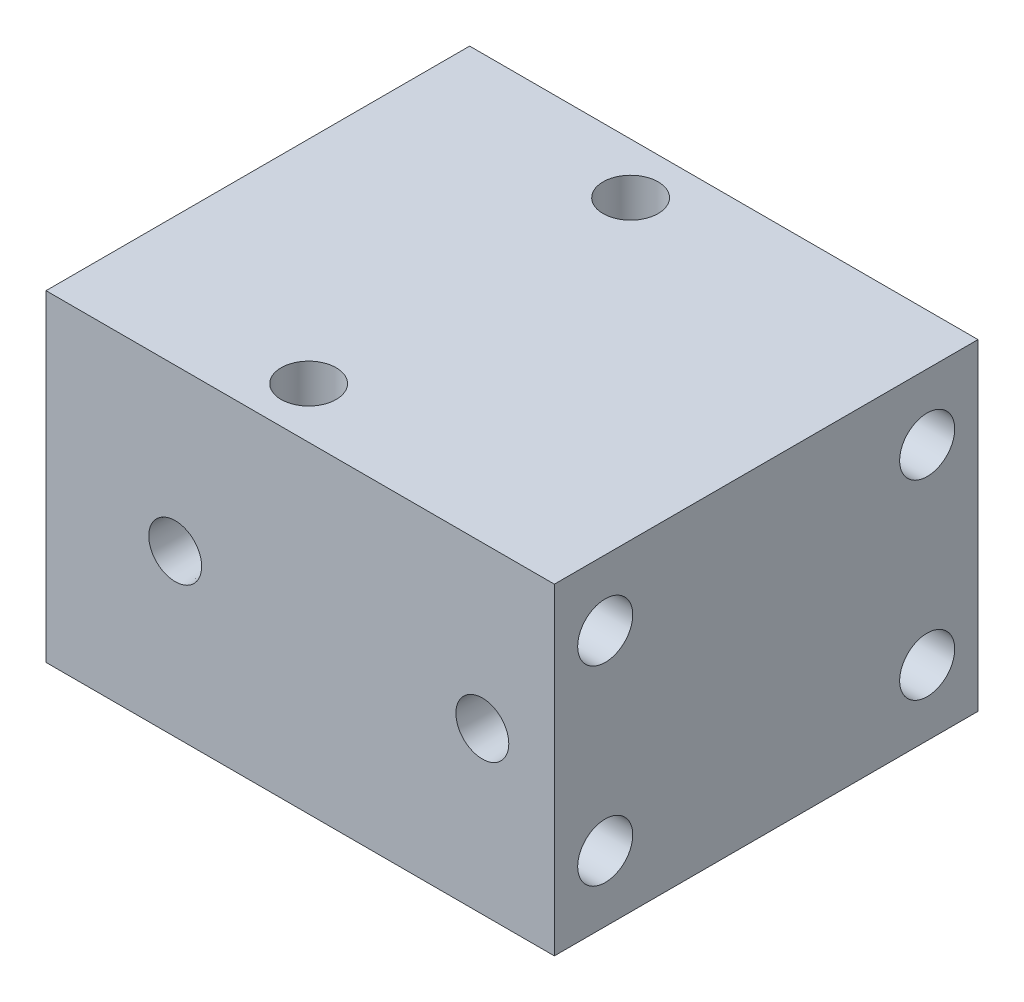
ISO-10303-21;
HEADER;
FILE_DESCRIPTION(('STEP AP214'),'2;1');
FILE_NAME('part.step','',(''),(''),'','','');
FILE_SCHEMA(('AUTOMOTIVE_DESIGN { 1 0 10303 214 1 1 1 1 }'));
ENDSEC;
DATA;
#1=APPLICATION_CONTEXT('core data for automotive mechanical design processes');
#2=APPLICATION_PROTOCOL_DEFINITION('international standard','automotive_design',2000,#1);
#3=PRODUCT_CONTEXT('',#1,'mechanical');
#4=PRODUCT('Part','Part','',(#3));
#5=PRODUCT_RELATED_PRODUCT_CATEGORY('part','',(#4));
#6=PRODUCT_DEFINITION_FORMATION('','',#4);
#7=PRODUCT_DEFINITION_CONTEXT('part definition',#1,'design');
#8=PRODUCT_DEFINITION('design','',#6,#7);
#9=PRODUCT_DEFINITION_SHAPE('','',#8);
#10=(LENGTH_UNIT() NAMED_UNIT(*) SI_UNIT(.MILLI.,.METRE.));
#11=(NAMED_UNIT(*) PLANE_ANGLE_UNIT() SI_UNIT($,.RADIAN.));
#12=(NAMED_UNIT(*) SI_UNIT($,.STERADIAN.) SOLID_ANGLE_UNIT());
#13=UNCERTAINTY_MEASURE_WITH_UNIT(LENGTH_MEASURE(1.E-05),#10,'distance_accuracy_value','');
#14=(GEOMETRIC_REPRESENTATION_CONTEXT(3) GLOBAL_UNCERTAINTY_ASSIGNED_CONTEXT((#13)) GLOBAL_UNIT_ASSIGNED_CONTEXT((#10,
#11,#12)) REPRESENTATION_CONTEXT('',''));
#15=CARTESIAN_POINT('',(0.,0.,0.));
#16=DIRECTION('',(0.,0.,1.));
#17=DIRECTION('',(1.,0.,0.));
#18=AXIS2_PLACEMENT_3D('',#15,#16,#17);
#19=CARTESIAN_POINT('',(-9.99999999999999,76.,38.));
#20=DIRECTION('',(0.,-1.,0.));
#21=DIRECTION('',(0.,0.,-1.));
#22=AXIS2_PLACEMENT_3D('',#19,#20,#21);
#23=CYLINDRICAL_SURFACE('',#22,6.5);
#24=CARTESIAN_POINT('',(-9.99999999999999,15.5,38.));
#25=DIRECTION('',(-0.707106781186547,-0.707106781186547,0.));
#26=DIRECTION('',(0.707106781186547,-0.707106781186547,0.));
#27=AXIS2_PLACEMENT_3D('',#24,#25,#26);
#28=ELLIPSE('',#27,9.19238815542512,6.5);
#29=CARTESIAN_POINT('',(-9.99999999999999,15.5,31.5));
#30=VERTEX_POINT('',#29);
#31=CARTESIAN_POINT('',(-9.99999999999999,15.5,44.5));
#32=VERTEX_POINT('',#31);
#33=EDGE_CURVE('E11',#30,#32,#28,.F.);
#34=ORIENTED_EDGE('',*,*,#33,.F.);
#35=CARTESIAN_POINT('',(-9.99999999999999,15.5,38.));
#36=DIRECTION('',(0.707106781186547,-0.707106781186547,0.));
#37=DIRECTION('',(-0.707106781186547,-0.707106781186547,0.));
#38=AXIS2_PLACEMENT_3D('',#35,#36,#37);
#39=ELLIPSE('',#38,9.19238815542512,6.5);
#40=EDGE_CURVE('E49',#32,#30,#39,.F.);
#41=ORIENTED_EDGE('',*,*,#40,.F.);
#42=EDGE_LOOP('',(#34,#41));
#43=FACE_BOUND('',#42,.T.);
#44=CARTESIAN_POINT('',(-9.99999999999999,60.5,38.));
#45=DIRECTION('',(-0.707106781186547,-0.707106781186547,0.));
#46=DIRECTION('',(0.707106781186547,-0.707106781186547,0.));
#47=AXIS2_PLACEMENT_3D('',#44,#45,#46);
#48=ELLIPSE('',#47,9.19238815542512,6.5);
#49=CARTESIAN_POINT('',(-9.99999999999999,60.5,31.5));
#50=VERTEX_POINT('',#49);
#51=CARTESIAN_POINT('',(-9.99999999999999,60.5,44.5));
#52=VERTEX_POINT('',#51);
#53=EDGE_CURVE('E263',#50,#52,#48,.T.);
#54=ORIENTED_EDGE('',*,*,#53,.F.);
#55=CARTESIAN_POINT('',(-9.99999999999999,60.5,38.));
#56=DIRECTION('',(0.707106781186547,-0.707106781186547,0.));
#57=DIRECTION('',(-0.707106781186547,-0.707106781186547,0.));
#58=AXIS2_PLACEMENT_3D('',#55,#56,#57);
#59=ELLIPSE('',#58,9.19238815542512,6.5);
#60=EDGE_CURVE('E261',#52,#50,#59,.T.);
#61=ORIENTED_EDGE('',*,*,#60,.F.);
#62=EDGE_LOOP('',(#54,#61));
#63=FACE_BOUND('',#62,.T.);
#64=ADVANCED_FACE('F33',(#43,#63),#23,.F.);
#65=CARTESIAN_POINT('',(-9.99999999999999,60.5,38.));
#66=DIRECTION('',(-0.707106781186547,-0.707106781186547,0.));
#67=DIRECTION('',(0.707106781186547,-0.707106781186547,0.));
#68=AXIS2_PLACEMENT_3D('',#65,#66,#67);
#69=ELLIPSE('',#68,9.19238815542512,6.5);
#70=EDGE_CURVE('E116',#50,#52,#69,.F.);
#71=ORIENTED_EDGE('',*,*,#70,.F.);
#72=CARTESIAN_POINT('',(-9.99999999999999,60.5,38.));
#73=DIRECTION('',(0.707106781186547,-0.707106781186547,0.));
#74=DIRECTION('',(-0.707106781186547,-0.707106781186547,0.));
#75=AXIS2_PLACEMENT_3D('',#72,#73,#74);
#76=ELLIPSE('',#75,9.19238815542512,6.5);
#77=EDGE_CURVE('E56',#52,#50,#76,.F.);
#78=ORIENTED_EDGE('',*,*,#77,.F.);
#79=EDGE_LOOP('',(#71,#78));
#80=FACE_BOUND('',#79,.T.);
#81=CARTESIAN_POINT('',(-9.99999999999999,76.,38.));
#82=DIRECTION('',(0.,1.,0.));
#83=DIRECTION('',(0.,0.,1.));
#84=AXIS2_PLACEMENT_3D('',#81,#82,#83);
#85=CIRCLE('',#84,6.5);
#86=CARTESIAN_POINT('',(-9.99999999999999,76.,44.5));
#87=VERTEX_POINT('',#86);
#88=EDGE_CURVE('E197',#87,#87,#85,.T.);
#89=ORIENTED_EDGE('',*,*,#88,.T.);
#90=EDGE_LOOP('',(#89));
#91=FACE_BOUND('',#90,.T.);
#92=ADVANCED_FACE('F318',(#80,#91),#23,.F.);
#93=CARTESIAN_POINT('',(-9.99999999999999,76.,-38.));
#94=DIRECTION('',(0.,-1.,0.));
#95=DIRECTION('',(0.,0.,-1.));
#96=AXIS2_PLACEMENT_3D('',#93,#94,#95);
#97=CYLINDRICAL_SURFACE('',#96,6.5);
#98=CARTESIAN_POINT('',(-9.99999999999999,15.5,-38.));
#99=DIRECTION('',(-0.707106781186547,-0.707106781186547,0.));
#100=DIRECTION('',(0.707106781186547,-0.707106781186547,0.));
#101=AXIS2_PLACEMENT_3D('',#98,#99,#100);
#102=ELLIPSE('',#101,9.19238815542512,6.5);
#103=CARTESIAN_POINT('',(-9.99999999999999,15.5,-44.5));
#104=VERTEX_POINT('',#103);
#105=CARTESIAN_POINT('',(-9.99999999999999,15.5,-31.5));
#106=VERTEX_POINT('',#105);
#107=EDGE_CURVE('E257',#104,#106,#102,.F.);
#108=ORIENTED_EDGE('',*,*,#107,.F.);
#109=CARTESIAN_POINT('',(-9.99999999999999,15.5,-38.));
#110=DIRECTION('',(0.707106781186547,-0.707106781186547,0.));
#111=DIRECTION('',(-0.707106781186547,-0.707106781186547,0.));
#112=AXIS2_PLACEMENT_3D('',#109,#110,#111);
#113=ELLIPSE('',#112,9.19238815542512,6.5);
#114=EDGE_CURVE('E249',#106,#104,#113,.F.);
#115=ORIENTED_EDGE('',*,*,#114,.F.);
#116=EDGE_LOOP('',(#108,#115));
#117=FACE_BOUND('',#116,.T.);
#118=CARTESIAN_POINT('',(-9.99999999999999,60.5,-38.));
#119=DIRECTION('',(-0.707106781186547,-0.707106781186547,0.));
#120=DIRECTION('',(0.707106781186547,-0.707106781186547,0.));
#121=AXIS2_PLACEMENT_3D('',#118,#119,#120);
#122=ELLIPSE('',#121,9.19238815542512,6.5);
#123=CARTESIAN_POINT('',(-9.99999999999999,60.5,-44.5));
#124=VERTEX_POINT('',#123);
#125=CARTESIAN_POINT('',(-9.99999999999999,60.5,-31.5));
#126=VERTEX_POINT('',#125);
#127=EDGE_CURVE('E243',#124,#126,#122,.T.);
#128=ORIENTED_EDGE('',*,*,#127,.F.);
#129=CARTESIAN_POINT('',(-9.99999999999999,60.5,-38.));
#130=DIRECTION('',(0.707106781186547,-0.707106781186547,0.));
#131=DIRECTION('',(-0.707106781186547,-0.707106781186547,0.));
#132=AXIS2_PLACEMENT_3D('',#129,#130,#131);
#133=ELLIPSE('',#132,9.19238815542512,6.5);
#134=EDGE_CURVE('E241',#126,#124,#133,.T.);
#135=ORIENTED_EDGE('',*,*,#134,.F.);
#136=EDGE_LOOP('',(#128,#135));
#137=FACE_BOUND('',#136,.T.);
#138=ADVANCED_FACE('F323',(#117,#137),#97,.F.);
#139=CARTESIAN_POINT('',(-9.99999999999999,60.5,-38.));
#140=DIRECTION('',(-0.707106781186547,-0.707106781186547,0.));
#141=DIRECTION('',(0.707106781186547,-0.707106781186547,0.));
#142=AXIS2_PLACEMENT_3D('',#139,#140,#141);
#143=ELLIPSE('',#142,9.19238815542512,6.5);
#144=EDGE_CURVE('E246',#124,#126,#143,.F.);
#145=ORIENTED_EDGE('',*,*,#144,.F.);
#146=CARTESIAN_POINT('',(-9.99999999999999,60.5,-38.));
#147=DIRECTION('',(0.707106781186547,-0.707106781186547,0.));
#148=DIRECTION('',(-0.707106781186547,-0.707106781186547,0.));
#149=AXIS2_PLACEMENT_3D('',#146,#147,#148);
#150=ELLIPSE('',#149,9.19238815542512,6.5);
#151=EDGE_CURVE('E238',#126,#124,#150,.F.);
#152=ORIENTED_EDGE('',*,*,#151,.F.);
#153=EDGE_LOOP('',(#145,#152));
#154=FACE_BOUND('',#153,.T.);
#155=CARTESIAN_POINT('',(-9.99999999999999,76.,-38.));
#156=DIRECTION('',(0.,1.,0.));
#157=DIRECTION('',(0.,0.,1.));
#158=AXIS2_PLACEMENT_3D('',#155,#156,#157);
#159=CIRCLE('',#158,6.5);
#160=CARTESIAN_POINT('',(-9.99999999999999,76.,-31.5));
#161=VERTEX_POINT('',#160);
#162=EDGE_CURVE('E203',#161,#161,#159,.T.);
#163=ORIENTED_EDGE('',*,*,#162,.T.);
#164=EDGE_LOOP('',(#163));
#165=FACE_BOUND('',#164,.T.);
#166=ADVANCED_FACE('F336',(#154,#165),#97,.F.);
#167=CARTESIAN_POINT('',(-60.,76.,50.));
#168=DIRECTION('',(0.,1.,0.));
#169=DIRECTION('',(0.,0.,1.));
#170=AXIS2_PLACEMENT_3D('',#167,#168,#169);
#171=PLANE('',#170);
#172=ORIENTED_EDGE('',*,*,#162,.F.);
#173=EDGE_LOOP('',(#172));
#174=FACE_BOUND('',#173,.T.);
#175=DIRECTION('',(0.,0.,1.));
#176=VECTOR('',#175,1.);
#177=CARTESIAN_POINT('',(-60.,76.,-50.));
#178=LINE('',#177,#176);
#179=CARTESIAN_POINT('',(-60.,76.,-50.));
#180=VERTEX_POINT('',#179);
#181=CARTESIAN_POINT('',(-60.,76.,50.));
#182=VERTEX_POINT('',#181);
#183=EDGE_CURVE('E209',#180,#182,#178,.T.);
#184=ORIENTED_EDGE('',*,*,#183,.T.);
#185=DIRECTION('',(1.,0.,0.));
#186=VECTOR('',#185,1.);
#187=CARTESIAN_POINT('',(-60.,76.,50.));
#188=LINE('',#187,#186);
#189=CARTESIAN_POINT('',(60.,76.,50.));
#190=VERTEX_POINT('',#189);
#191=EDGE_CURVE('E212',#182,#190,#188,.T.);
#192=ORIENTED_EDGE('',*,*,#191,.T.);
#193=DIRECTION('',(0.,0.,-1.));
#194=VECTOR('',#193,1.);
#195=CARTESIAN_POINT('',(60.,76.,-50.));
#196=LINE('',#195,#194);
#197=CARTESIAN_POINT('',(60.,76.,-50.));
#198=VERTEX_POINT('',#197);
#199=EDGE_CURVE('E215',#190,#198,#196,.T.);
#200=ORIENTED_EDGE('',*,*,#199,.T.);
#201=DIRECTION('',(-1.,0.,0.));
#202=VECTOR('',#201,1.);
#203=CARTESIAN_POINT('',(-60.,76.,-50.));
#204=LINE('',#203,#202);
#205=EDGE_CURVE('E217',#198,#180,#204,.T.);
#206=ORIENTED_EDGE('',*,*,#205,.T.);
#207=EDGE_LOOP('',(#184,#192,#200,#206));
#208=FACE_BOUND('',#207,.T.);
#209=ORIENTED_EDGE('',*,*,#88,.F.);
#210=EDGE_LOOP('',(#209));
#211=FACE_BOUND('',#210,.T.);
#212=ADVANCED_FACE('F306',(#174,#208,#211),#171,.T.);
#213=CARTESIAN_POINT('',(-60.,0.,50.));
#214=DIRECTION('',(0.,1.,0.));
#215=DIRECTION('',(0.,0.,1.));
#216=AXIS2_PLACEMENT_3D('',#213,#214,#215);
#217=PLANE('',#216);
#218=CARTESIAN_POINT('',(-9.99999999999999,0.,-38.));
#219=DIRECTION('',(0.,1.,0.));
#220=DIRECTION('',(0.,0.,1.));
#221=AXIS2_PLACEMENT_3D('',#218,#219,#220);
#222=CIRCLE('',#221,6.5);
#223=CARTESIAN_POINT('',(-9.99999999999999,0.,-31.5));
#224=VERTEX_POINT('',#223);
#225=EDGE_CURVE('E200',#224,#224,#222,.T.);
#226=ORIENTED_EDGE('',*,*,#225,.T.);
#227=EDGE_LOOP('',(#226));
#228=FACE_BOUND('',#227,.T.);
#229=DIRECTION('',(0.,0.,1.));
#230=VECTOR('',#229,1.);
#231=CARTESIAN_POINT('',(-60.,0.,-50.));
#232=LINE('',#231,#230);
#233=CARTESIAN_POINT('',(-60.,0.,-50.));
#234=VERTEX_POINT('',#233);
#235=CARTESIAN_POINT('',(-60.,0.,50.));
#236=VERTEX_POINT('',#235);
#237=EDGE_CURVE('E206',#234,#236,#232,.T.);
#238=ORIENTED_EDGE('',*,*,#237,.F.);
#239=DIRECTION('',(-1.,0.,0.));
#240=VECTOR('',#239,1.);
#241=CARTESIAN_POINT('',(-60.,0.,-50.));
#242=LINE('',#241,#240);
#243=CARTESIAN_POINT('',(60.,0.,-50.));
#244=VERTEX_POINT('',#243);
#245=EDGE_CURVE('E213',#244,#234,#242,.T.);
#246=ORIENTED_EDGE('',*,*,#245,.F.);
#247=DIRECTION('',(0.,0.,-1.));
#248=VECTOR('',#247,1.);
#249=CARTESIAN_POINT('',(60.,0.,-50.));
#250=LINE('',#249,#248);
#251=CARTESIAN_POINT('',(60.,0.,50.));
#252=VERTEX_POINT('',#251);
#253=EDGE_CURVE('E224',#252,#244,#250,.T.);
#254=ORIENTED_EDGE('',*,*,#253,.F.);
#255=DIRECTION('',(1.,0.,0.));
#256=VECTOR('',#255,1.);
#257=CARTESIAN_POINT('',(-60.,0.,50.));
#258=LINE('',#257,#256);
#259=EDGE_CURVE('E222',#236,#252,#258,.T.);
#260=ORIENTED_EDGE('',*,*,#259,.F.);
#261=EDGE_LOOP('',(#238,#246,#254,#260));
#262=FACE_BOUND('',#261,.T.);
#263=CARTESIAN_POINT('',(-9.99999999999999,0.,38.));
#264=DIRECTION('',(0.,1.,0.));
#265=DIRECTION('',(0.,0.,1.));
#266=AXIS2_PLACEMENT_3D('',#263,#264,#265);
#267=CIRCLE('',#266,6.5);
#268=CARTESIAN_POINT('',(-9.99999999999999,0.,44.5));
#269=VERTEX_POINT('',#268);
#270=EDGE_CURVE('E194',#269,#269,#267,.T.);
#271=ORIENTED_EDGE('',*,*,#270,.T.);
#272=EDGE_LOOP('',(#271));
#273=FACE_BOUND('',#272,.T.);
#274=ADVANCED_FACE('F300',(#228,#262,#273),#217,.F.);
#275=CARTESIAN_POINT('',(-60.,76.,-50.));
#276=DIRECTION('',(1.,0.,0.));
#277=DIRECTION('',(0.,0.,-1.));
#278=AXIS2_PLACEMENT_3D('',#275,#276,#277);
#279=PLANE('',#278);
#280=CARTESIAN_POINT('',(-60.,15.5,38.));
#281=DIRECTION('',(-1.,0.,0.));
#282=DIRECTION('',(0.,0.,1.));
#283=AXIS2_PLACEMENT_3D('',#280,#281,#282);
#284=CIRCLE('',#283,6.5);
#285=CARTESIAN_POINT('',(-60.,15.5,44.5));
#286=VERTEX_POINT('',#285);
#287=EDGE_CURVE('E129',#286,#286,#284,.T.);
#288=ORIENTED_EDGE('',*,*,#287,.F.);
#289=EDGE_LOOP('',(#288));
#290=FACE_BOUND('',#289,.T.);
#291=CARTESIAN_POINT('',(-60.,60.5,38.));
#292=DIRECTION('',(-1.,0.,0.));
#293=DIRECTION('',(0.,0.,1.));
#294=AXIS2_PLACEMENT_3D('',#291,#292,#293);
#295=CIRCLE('',#294,6.5);
#296=CARTESIAN_POINT('',(-60.,60.5,44.5));
#297=VERTEX_POINT('',#296);
#298=EDGE_CURVE('E148',#297,#297,#295,.T.);
#299=ORIENTED_EDGE('',*,*,#298,.F.);
#300=EDGE_LOOP('',(#299));
#301=FACE_BOUND('',#300,.T.);
#302=CARTESIAN_POINT('',(-60.,15.5,-38.));
#303=DIRECTION('',(-1.,0.,0.));
#304=DIRECTION('',(0.,0.,1.));
#305=AXIS2_PLACEMENT_3D('',#302,#303,#304);
#306=CIRCLE('',#305,6.5);
#307=CARTESIAN_POINT('',(-60.,15.5,-31.5));
#308=VERTEX_POINT('',#307);
#309=EDGE_CURVE('E154',#308,#308,#306,.T.);
#310=ORIENTED_EDGE('',*,*,#309,.F.);
#311=EDGE_LOOP('',(#310));
#312=FACE_BOUND('',#311,.T.);
#313=CARTESIAN_POINT('',(-60.,60.5,-38.));
#314=DIRECTION('',(-1.,0.,0.));
#315=DIRECTION('',(0.,0.,1.));
#316=AXIS2_PLACEMENT_3D('',#313,#314,#315);
#317=CIRCLE('',#316,6.5);
#318=CARTESIAN_POINT('',(-60.,60.5,-31.5));
#319=VERTEX_POINT('',#318);
#320=EDGE_CURVE('E160',#319,#319,#317,.T.);
#321=ORIENTED_EDGE('',*,*,#320,.F.);
#322=EDGE_LOOP('',(#321));
#323=FACE_BOUND('',#322,.T.);
#324=CARTESIAN_POINT('',(-60.,38.,0.));
#325=DIRECTION('',(-1.,0.,0.));
#326=DIRECTION('',(0.,0.,1.));
#327=AXIS2_PLACEMENT_3D('',#324,#325,#326);
#328=CIRCLE('',#327,0.500000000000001);
#329=CARTESIAN_POINT('',(-60.,38.,0.500000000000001));
#330=VERTEX_POINT('',#329);
#331=EDGE_CURVE('E190',#330,#330,#328,.T.);
#332=ORIENTED_EDGE('',*,*,#331,.F.);
#333=EDGE_LOOP('',(#332));
#334=FACE_BOUND('',#333,.T.);
#335=ORIENTED_EDGE('',*,*,#237,.T.);
#336=DIRECTION('',(0.,-1.,0.));
#337=VECTOR('',#336,1.);
#338=CARTESIAN_POINT('',(-60.,76.,50.));
#339=LINE('',#338,#337);
#340=EDGE_CURVE('E235',#182,#236,#339,.T.);
#341=ORIENTED_EDGE('',*,*,#340,.F.);
#342=ORIENTED_EDGE('',*,*,#183,.F.);
#343=DIRECTION('',(0.,-1.,0.));
#344=VECTOR('',#343,1.);
#345=CARTESIAN_POINT('',(-60.,76.,-50.));
#346=LINE('',#345,#344);
#347=EDGE_CURVE('E219',#180,#234,#346,.T.);
#348=ORIENTED_EDGE('',*,*,#347,.T.);
#349=EDGE_LOOP('',(#335,#341,#342,#348));
#350=FACE_BOUND('',#349,.T.);
#351=ADVANCED_FACE('F35',(#290,#301,#312,#323,#334,#350),#279,.F.);
#352=CARTESIAN_POINT('',(-60.,76.,50.));
#353=DIRECTION('',(0.,0.,-1.));
#354=DIRECTION('',(-1.,0.,0.));
#355=AXIS2_PLACEMENT_3D('',#352,#353,#354);
#356=PLANE('',#355);
#357=CARTESIAN_POINT('',(43.,38.,50.));
#358=DIRECTION('',(0.,0.,1.));
#359=DIRECTION('',(1.,0.,0.));
#360=AXIS2_PLACEMENT_3D('',#357,#358,#359);
#361=CIRCLE('',#360,6.2436883);
#362=CARTESIAN_POINT('',(49.2436883,38.,50.));
#363=VERTEX_POINT('',#362);
#364=EDGE_CURVE('E166',#363,#363,#361,.T.);
#365=ORIENTED_EDGE('',*,*,#364,.F.);
#366=EDGE_LOOP('',(#365));
#367=FACE_BOUND('',#366,.T.);
#368=CARTESIAN_POINT('',(-29.5,38.,50.));
#369=DIRECTION('',(0.,0.,1.));
#370=DIRECTION('',(1.,0.,0.));
#371=AXIS2_PLACEMENT_3D('',#368,#369,#370);
#372=CIRCLE('',#371,6.2436883);
#373=CARTESIAN_POINT('',(-23.2563117,38.,50.));
#374=VERTEX_POINT('',#373);
#375=EDGE_CURVE('E178',#374,#374,#372,.T.);
#376=ORIENTED_EDGE('',*,*,#375,.F.);
#377=EDGE_LOOP('',(#376));
#378=FACE_BOUND('',#377,.T.);
#379=ORIENTED_EDGE('',*,*,#259,.T.);
#380=DIRECTION('',(0.,-1.,0.));
#381=VECTOR('',#380,1.);
#382=CARTESIAN_POINT('',(60.,76.,50.));
#383=LINE('',#382,#381);
#384=EDGE_CURVE('E232',#190,#252,#383,.T.);
#385=ORIENTED_EDGE('',*,*,#384,.F.);
#386=ORIENTED_EDGE('',*,*,#191,.F.);
#387=ORIENTED_EDGE('',*,*,#340,.T.);
#388=EDGE_LOOP('',(#379,#385,#386,#387));
#389=FACE_BOUND('',#388,.T.);
#390=ADVANCED_FACE('F283',(#367,#378,#389),#356,.F.);
#391=CARTESIAN_POINT('',(60.,76.,-50.));
#392=DIRECTION('',(-1.,0.,0.));
#393=DIRECTION('',(0.,0.,1.));
#394=AXIS2_PLACEMENT_3D('',#391,#392,#393);
#395=PLANE('',#394);
#396=CARTESIAN_POINT('',(60.,15.5,38.));
#397=DIRECTION('',(-1.,0.,0.));
#398=DIRECTION('',(0.,0.,1.));
#399=AXIS2_PLACEMENT_3D('',#396,#397,#398);
#400=CIRCLE('',#399,6.5);
#401=CARTESIAN_POINT('',(60.,15.5,44.5));
#402=VERTEX_POINT('',#401);
#403=EDGE_CURVE('E145',#402,#402,#400,.F.);
#404=ORIENTED_EDGE('',*,*,#403,.F.);
#405=EDGE_LOOP('',(#404));
#406=FACE_BOUND('',#405,.T.);
#407=CARTESIAN_POINT('',(60.,60.5,38.));
#408=DIRECTION('',(-1.,0.,0.));
#409=DIRECTION('',(0.,0.,1.));
#410=AXIS2_PLACEMENT_3D('',#407,#408,#409);
#411=CIRCLE('',#410,6.5);
#412=CARTESIAN_POINT('',(60.,60.5,44.5));
#413=VERTEX_POINT('',#412);
#414=EDGE_CURVE('E151',#413,#413,#411,.F.);
#415=ORIENTED_EDGE('',*,*,#414,.F.);
#416=EDGE_LOOP('',(#415));
#417=FACE_BOUND('',#416,.T.);
#418=CARTESIAN_POINT('',(60.,15.5,-38.));
#419=DIRECTION('',(-1.,0.,0.));
#420=DIRECTION('',(0.,0.,1.));
#421=AXIS2_PLACEMENT_3D('',#418,#419,#420);
#422=CIRCLE('',#421,6.5);
#423=CARTESIAN_POINT('',(60.,15.5,-31.5));
#424=VERTEX_POINT('',#423);
#425=EDGE_CURVE('E157',#424,#424,#422,.F.);
#426=ORIENTED_EDGE('',*,*,#425,.F.);
#427=EDGE_LOOP('',(#426));
#428=FACE_BOUND('',#427,.T.);
#429=CARTESIAN_POINT('',(60.,60.5,-38.));
#430=DIRECTION('',(-1.,0.,0.));
#431=DIRECTION('',(0.,0.,1.));
#432=AXIS2_PLACEMENT_3D('',#429,#430,#431);
#433=CIRCLE('',#432,6.5);
#434=CARTESIAN_POINT('',(60.,60.5,-31.5));
#435=VERTEX_POINT('',#434);
#436=EDGE_CURVE('E163',#435,#435,#433,.F.);
#437=ORIENTED_EDGE('',*,*,#436,.F.);
#438=EDGE_LOOP('',(#437));
#439=FACE_BOUND('',#438,.T.);
#440=ORIENTED_EDGE('',*,*,#253,.T.);
#441=DIRECTION('',(0.,-1.,0.));
#442=VECTOR('',#441,1.);
#443=CARTESIAN_POINT('',(60.,76.,-50.));
#444=LINE('',#443,#442);
#445=EDGE_CURVE('E229',#198,#244,#444,.T.);
#446=ORIENTED_EDGE('',*,*,#445,.F.);
#447=ORIENTED_EDGE('',*,*,#199,.F.);
#448=ORIENTED_EDGE('',*,*,#384,.T.);
#449=EDGE_LOOP('',(#440,#446,#447,#448));
#450=FACE_BOUND('',#449,.T.);
#451=ADVANCED_FACE('F279',(#406,#417,#428,#439,#450),#395,.F.);
#452=CARTESIAN_POINT('',(-60.,76.,-50.));
#453=DIRECTION('',(0.,0.,1.));
#454=DIRECTION('',(1.,0.,0.));
#455=AXIS2_PLACEMENT_3D('',#452,#453,#454);
#456=PLANE('',#455);
#457=ORIENTED_EDGE('',*,*,#245,.T.);
#458=ORIENTED_EDGE('',*,*,#347,.F.);
#459=ORIENTED_EDGE('',*,*,#205,.F.);
#460=ORIENTED_EDGE('',*,*,#445,.T.);
#461=EDGE_LOOP('',(#457,#458,#459,#460));
#462=FACE_BOUND('',#461,.T.);
#463=ADVANCED_FACE('F282',(#462),#456,.F.);
#464=CARTESIAN_POINT('',(-9.99999999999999,15.5,-38.));
#465=DIRECTION('',(-0.707106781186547,-0.707106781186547,0.));
#466=DIRECTION('',(0.707106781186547,-0.707106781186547,0.));
#467=AXIS2_PLACEMENT_3D('',#464,#465,#466);
#468=ELLIPSE('',#467,9.19238815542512,6.5);
#469=EDGE_CURVE('E254',#104,#106,#468,.T.);
#470=ORIENTED_EDGE('',*,*,#469,.F.);
#471=CARTESIAN_POINT('',(-9.99999999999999,15.5,-38.));
#472=DIRECTION('',(0.707106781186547,-0.707106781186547,0.));
#473=DIRECTION('',(-0.707106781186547,-0.707106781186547,0.));
#474=AXIS2_PLACEMENT_3D('',#471,#472,#473);
#475=ELLIPSE('',#474,9.19238815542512,6.5);
#476=EDGE_CURVE('E252',#106,#104,#475,.T.);
#477=ORIENTED_EDGE('',*,*,#476,.F.);
#478=EDGE_LOOP('',(#470,#477));
#479=FACE_BOUND('',#478,.T.);
#480=ORIENTED_EDGE('',*,*,#225,.F.);
#481=EDGE_LOOP('',(#480));
#482=FACE_BOUND('',#481,.T.);
#483=ADVANCED_FACE('F328',(#479,#482),#97,.F.);
#484=CARTESIAN_POINT('',(-9.99999999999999,15.5,38.));
#485=DIRECTION('',(-0.707106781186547,-0.707106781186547,0.));
#486=DIRECTION('',(0.707106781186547,-0.707106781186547,0.));
#487=AXIS2_PLACEMENT_3D('',#484,#485,#486);
#488=ELLIPSE('',#487,9.19238815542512,6.5);
#489=EDGE_CURVE('E42',#30,#32,#488,.T.);
#490=ORIENTED_EDGE('',*,*,#489,.F.);
#491=CARTESIAN_POINT('',(-9.99999999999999,15.5,38.));
#492=DIRECTION('',(0.707106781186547,-0.707106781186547,0.));
#493=DIRECTION('',(-0.707106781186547,-0.707106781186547,0.));
#494=AXIS2_PLACEMENT_3D('',#491,#492,#493);
#495=ELLIPSE('',#494,9.19238815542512,6.5);
#496=EDGE_CURVE('E107',#32,#30,#495,.T.);
#497=ORIENTED_EDGE('',*,*,#496,.F.);
#498=EDGE_LOOP('',(#490,#497));
#499=FACE_BOUND('',#498,.T.);
#500=ORIENTED_EDGE('',*,*,#270,.F.);
#501=EDGE_LOOP('',(#500));
#502=FACE_BOUND('',#501,.T.);
#503=ADVANCED_FACE('F119',(#499,#502),#23,.F.);
#504=CARTESIAN_POINT('',(0.,38.,0.));
#505=DIRECTION('',(-1.,0.,0.));
#506=DIRECTION('',(0.,0.,1.));
#507=AXIS2_PLACEMENT_3D('',#504,#505,#506);
#508=CYLINDRICAL_SURFACE('',#507,0.500000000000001);
#509=CARTESIAN_POINT('',(0.,38.,0.));
#510=DIRECTION('',(-1.,0.,0.));
#511=DIRECTION('',(0.,0.,1.));
#512=AXIS2_PLACEMENT_3D('',#509,#510,#511);
#513=CIRCLE('',#512,0.500000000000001);
#514=CARTESIAN_POINT('',(0.,38.,0.499999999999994));
#515=VERTEX_POINT('',#514);
#516=EDGE_CURVE('E191',#515,#515,#513,.T.);
#517=ORIENTED_EDGE('',*,*,#516,.F.);
#518=EDGE_LOOP('',(#517));
#519=FACE_BOUND('',#518,.T.);
#520=ORIENTED_EDGE('',*,*,#331,.T.);
#521=EDGE_LOOP('',(#520));
#522=FACE_BOUND('',#521,.T.);
#523=ADVANCED_FACE('F327',(#519,#522),#508,.F.);
#524=CARTESIAN_POINT('',(0.,38.,0.));
#525=DIRECTION('',(-1.,0.,0.));
#526=DIRECTION('',(0.,0.,1.));
#527=AXIS2_PLACEMENT_3D('',#524,#525,#526);
#528=PLANE('',#527);
#529=ORIENTED_EDGE('',*,*,#516,.T.);
#530=EDGE_LOOP('',(#529));
#531=FACE_BOUND('',#530,.T.);
#532=ADVANCED_FACE('F333',(#531),#528,.T.);
#533=CARTESIAN_POINT('',(-29.5,38.,32.93));
#534=DIRECTION('',(0.,0.,1.));
#535=DIRECTION('',(1.,0.,0.));
#536=AXIS2_PLACEMENT_3D('',#533,#534,#535);
#537=CONICAL_SURFACE('',#536,5.5626,1.02974425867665);
#538=CARTESIAN_POINT('',(-29.5,38.,30.7893739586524));
#539=DIRECTION('',(0.,0.,1.));
#540=DIRECTION('',(1.,0.,0.));
#541=AXIS2_PLACEMENT_3D('',#538,#539,#540);
#542=CIRCLE('',#541,2.00000000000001);
#543=CARTESIAN_POINT('',(-27.5,38.,30.7893739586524));
#544=VERTEX_POINT('',#543);
#545=EDGE_CURVE('E126',#544,#544,#542,.F.);
#546=ORIENTED_EDGE('',*,*,#545,.T.);
#547=EDGE_LOOP('',(#546));
#548=FACE_BOUND('',#547,.T.);
#549=CARTESIAN_POINT('',(-29.5,38.,32.93));
#550=DIRECTION('',(0.,0.,1.));
#551=DIRECTION('',(1.,0.,0.));
#552=AXIS2_PLACEMENT_3D('',#549,#550,#551);
#553=CIRCLE('',#552,5.5626);
#554=CARTESIAN_POINT('',(-23.9374,38.,32.93));
#555=VERTEX_POINT('',#554);
#556=EDGE_CURVE('E187',#555,#555,#553,.T.);
#557=ORIENTED_EDGE('',*,*,#556,.T.);
#558=EDGE_LOOP('',(#557));
#559=FACE_BOUND('',#558,.T.);
#560=ADVANCED_FACE('F399',(#548,#559),#537,.F.);
#561=CARTESIAN_POINT('',(-29.5,38.,50.));
#562=DIRECTION('',(0.,0.,1.));
#563=DIRECTION('',(1.,0.,0.));
#564=AXIS2_PLACEMENT_3D('',#561,#562,#563);
#565=CYLINDRICAL_SURFACE('',#564,5.5626);
#566=ORIENTED_EDGE('',*,*,#556,.F.);
#567=EDGE_LOOP('',(#566));
#568=FACE_BOUND('',#567,.T.);
#569=CARTESIAN_POINT('',(-29.5,38.,39.98));
#570=DIRECTION('',(0.,0.,1.));
#571=DIRECTION('',(1.,0.,0.));
#572=AXIS2_PLACEMENT_3D('',#569,#570,#571);
#573=CIRCLE('',#572,5.5626);
#574=CARTESIAN_POINT('',(-23.9374,38.,39.98));
#575=VERTEX_POINT('',#574);
#576=EDGE_CURVE('E184',#575,#575,#573,.T.);
#577=ORIENTED_EDGE('',*,*,#576,.T.);
#578=EDGE_LOOP('',(#577));
#579=FACE_BOUND('',#578,.T.);
#580=ADVANCED_FACE('F395',(#568,#579),#565,.F.);
#581=CARTESIAN_POINT('',(-23.9374,38.,39.98));
#582=DIRECTION('',(0.,0.,-1.));
#583=DIRECTION('',(-1.,0.,0.));
#584=AXIS2_PLACEMENT_3D('',#581,#582,#583);
#585=PLANE('',#584);
#586=ORIENTED_EDGE('',*,*,#576,.F.);
#587=EDGE_LOOP('',(#586));
#588=FACE_BOUND('',#587,.T.);
#589=CARTESIAN_POINT('',(-29.5,38.,39.98));
#590=DIRECTION('',(0.,0.,1.));
#591=DIRECTION('',(1.,0.,0.));
#592=AXIS2_PLACEMENT_3D('',#589,#590,#591);
#593=CIRCLE('',#592,5.94367608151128);
#594=CARTESIAN_POINT('',(-23.5563239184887,38.,39.98));
#595=VERTEX_POINT('',#594);
#596=EDGE_CURVE('E181',#595,#595,#593,.T.);
#597=ORIENTED_EDGE('',*,*,#596,.T.);
#598=EDGE_LOOP('',(#597));
#599=FACE_BOUND('',#598,.T.);
#600=ADVANCED_FACE('F391',(#588,#599),#585,.F.);
#601=CARTESIAN_POINT('',(-29.5,38.,50.));
#602=DIRECTION('',(0.,0.,1.));
#603=DIRECTION('',(1.,0.,0.));
#604=AXIS2_PLACEMENT_3D('',#601,#602,#603);
#605=CONICAL_SURFACE('',#604,6.2436883,0.0299323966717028);
#606=ORIENTED_EDGE('',*,*,#596,.F.);
#607=EDGE_LOOP('',(#606));
#608=FACE_BOUND('',#607,.T.);
#609=ORIENTED_EDGE('',*,*,#375,.T.);
#610=EDGE_LOOP('',(#609));
#611=FACE_BOUND('',#610,.T.);
#612=ADVANCED_FACE('F386',(#608,#611),#605,.F.);
#613=CARTESIAN_POINT('',(43.,38.,32.93));
#614=DIRECTION('',(0.,0.,1.));
#615=DIRECTION('',(1.,0.,0.));
#616=AXIS2_PLACEMENT_3D('',#613,#614,#615);
#617=CONICAL_SURFACE('',#616,5.5626,1.02974425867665);
#618=CARTESIAN_POINT('',(43.,38.,30.7893739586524));
#619=DIRECTION('',(0.,0.,1.));
#620=DIRECTION('',(1.,0.,0.));
#621=AXIS2_PLACEMENT_3D('',#618,#619,#620);
#622=CIRCLE('',#621,2.);
#623=CARTESIAN_POINT('',(45.,38.,30.7893739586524));
#624=VERTEX_POINT('',#623);
#625=EDGE_CURVE('E37',#624,#624,#622,.F.);
#626=ORIENTED_EDGE('',*,*,#625,.T.);
#627=EDGE_LOOP('',(#626));
#628=FACE_BOUND('',#627,.T.);
#629=CARTESIAN_POINT('',(43.,38.,32.93));
#630=DIRECTION('',(0.,0.,1.));
#631=DIRECTION('',(1.,0.,0.));
#632=AXIS2_PLACEMENT_3D('',#629,#630,#631);
#633=CIRCLE('',#632,5.5626);
#634=CARTESIAN_POINT('',(48.5626,38.,32.93));
#635=VERTEX_POINT('',#634);
#636=EDGE_CURVE('E175',#635,#635,#633,.T.);
#637=ORIENTED_EDGE('',*,*,#636,.T.);
#638=EDGE_LOOP('',(#637));
#639=FACE_BOUND('',#638,.T.);
#640=ADVANCED_FACE('F382',(#628,#639),#617,.F.);
#641=CARTESIAN_POINT('',(43.,38.,50.));
#642=DIRECTION('',(0.,0.,1.));
#643=DIRECTION('',(1.,0.,0.));
#644=AXIS2_PLACEMENT_3D('',#641,#642,#643);
#645=CYLINDRICAL_SURFACE('',#644,5.5626);
#646=ORIENTED_EDGE('',*,*,#636,.F.);
#647=EDGE_LOOP('',(#646));
#648=FACE_BOUND('',#647,.T.);
#649=CARTESIAN_POINT('',(43.,38.,39.98));
#650=DIRECTION('',(0.,0.,1.));
#651=DIRECTION('',(1.,0.,0.));
#652=AXIS2_PLACEMENT_3D('',#649,#650,#651);
#653=CIRCLE('',#652,5.5626);
#654=CARTESIAN_POINT('',(48.5626,38.,39.98));
#655=VERTEX_POINT('',#654);
#656=EDGE_CURVE('E172',#655,#655,#653,.T.);
#657=ORIENTED_EDGE('',*,*,#656,.T.);
#658=EDGE_LOOP('',(#657));
#659=FACE_BOUND('',#658,.T.);
#660=ADVANCED_FACE('F378',(#648,#659),#645,.F.);
#661=CARTESIAN_POINT('',(48.5626,38.,39.98));
#662=DIRECTION('',(0.,0.,-1.));
#663=DIRECTION('',(-1.,0.,0.));
#664=AXIS2_PLACEMENT_3D('',#661,#662,#663);
#665=PLANE('',#664);
#666=ORIENTED_EDGE('',*,*,#656,.F.);
#667=EDGE_LOOP('',(#666));
#668=FACE_BOUND('',#667,.T.);
#669=CARTESIAN_POINT('',(43.,38.,39.98));
#670=DIRECTION('',(0.,0.,1.));
#671=DIRECTION('',(1.,0.,0.));
#672=AXIS2_PLACEMENT_3D('',#669,#670,#671);
#673=CIRCLE('',#672,5.94367608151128);
#674=CARTESIAN_POINT('',(48.9436760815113,38.,39.98));
#675=VERTEX_POINT('',#674);
#676=EDGE_CURVE('E169',#675,#675,#673,.T.);
#677=ORIENTED_EDGE('',*,*,#676,.T.);
#678=EDGE_LOOP('',(#677));
#679=FACE_BOUND('',#678,.T.);
#680=ADVANCED_FACE('F371',(#668,#679),#665,.F.);
#681=CARTESIAN_POINT('',(43.,38.,50.));
#682=DIRECTION('',(0.,0.,1.));
#683=DIRECTION('',(1.,0.,0.));
#684=AXIS2_PLACEMENT_3D('',#681,#682,#683);
#685=CONICAL_SURFACE('',#684,6.2436883,0.0299323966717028);
#686=ORIENTED_EDGE('',*,*,#676,.F.);
#687=EDGE_LOOP('',(#686));
#688=FACE_BOUND('',#687,.T.);
#689=ORIENTED_EDGE('',*,*,#364,.T.);
#690=EDGE_LOOP('',(#689));
#691=FACE_BOUND('',#690,.T.);
#692=ADVANCED_FACE('F364',(#688,#691),#685,.F.);
#693=CARTESIAN_POINT('',(78.3847763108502,60.5,-38.));
#694=DIRECTION('',(-1.,0.,0.));
#695=DIRECTION('',(0.,0.,1.));
#696=AXIS2_PLACEMENT_3D('',#693,#694,#695);
#697=CYLINDRICAL_SURFACE('',#696,6.5);
#698=ORIENTED_EDGE('',*,*,#127,.T.);
#699=ORIENTED_EDGE('',*,*,#151,.T.);
#700=EDGE_LOOP('',(#698,#699));
#701=FACE_BOUND('',#700,.T.);
#702=ORIENTED_EDGE('',*,*,#436,.T.);
#703=EDGE_LOOP('',(#702));
#704=FACE_BOUND('',#703,.T.);
#705=ADVANCED_FACE('F360',(#701,#704),#697,.F.);
#706=ORIENTED_EDGE('',*,*,#144,.T.);
#707=ORIENTED_EDGE('',*,*,#134,.T.);
#708=EDGE_LOOP('',(#706,#707));
#709=FACE_BOUND('',#708,.T.);
#710=ORIENTED_EDGE('',*,*,#320,.T.);
#711=EDGE_LOOP('',(#710));
#712=FACE_BOUND('',#711,.T.);
#713=ADVANCED_FACE('F363',(#709,#712),#697,.F.);
#714=CARTESIAN_POINT('',(78.3847763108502,15.5,-38.));
#715=DIRECTION('',(-1.,0.,0.));
#716=DIRECTION('',(0.,0.,1.));
#717=AXIS2_PLACEMENT_3D('',#714,#715,#716);
#718=CYLINDRICAL_SURFACE('',#717,6.5);
#719=ORIENTED_EDGE('',*,*,#469,.T.);
#720=ORIENTED_EDGE('',*,*,#114,.T.);
#721=EDGE_LOOP('',(#719,#720));
#722=FACE_BOUND('',#721,.T.);
#723=ORIENTED_EDGE('',*,*,#425,.T.);
#724=EDGE_LOOP('',(#723));
#725=FACE_BOUND('',#724,.T.);
#726=ADVANCED_FACE('F370',(#722,#725),#718,.F.);
#727=ORIENTED_EDGE('',*,*,#107,.T.);
#728=ORIENTED_EDGE('',*,*,#476,.T.);
#729=EDGE_LOOP('',(#727,#728));
#730=FACE_BOUND('',#729,.T.);
#731=ORIENTED_EDGE('',*,*,#309,.T.);
#732=EDGE_LOOP('',(#731));
#733=FACE_BOUND('',#732,.T.);
#734=ADVANCED_FACE('F275',(#730,#733),#718,.F.);
#735=CARTESIAN_POINT('',(78.3847763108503,60.5,38.));
#736=DIRECTION('',(-1.,0.,0.));
#737=DIRECTION('',(0.,0.,1.));
#738=AXIS2_PLACEMENT_3D('',#735,#736,#737);
#739=CYLINDRICAL_SURFACE('',#738,6.5);
#740=ORIENTED_EDGE('',*,*,#53,.T.);
#741=ORIENTED_EDGE('',*,*,#77,.T.);
#742=EDGE_LOOP('',(#740,#741));
#743=FACE_BOUND('',#742,.T.);
#744=ORIENTED_EDGE('',*,*,#414,.T.);
#745=EDGE_LOOP('',(#744));
#746=FACE_BOUND('',#745,.T.);
#747=ADVANCED_FACE('F272',(#743,#746),#739,.F.);
#748=ORIENTED_EDGE('',*,*,#70,.T.);
#749=ORIENTED_EDGE('',*,*,#60,.T.);
#750=EDGE_LOOP('',(#748,#749));
#751=FACE_BOUND('',#750,.T.);
#752=ORIENTED_EDGE('',*,*,#298,.T.);
#753=EDGE_LOOP('',(#752));
#754=FACE_BOUND('',#753,.T.);
#755=ADVANCED_FACE('F268',(#751,#754),#739,.F.);
#756=CARTESIAN_POINT('',(78.3847763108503,15.5,38.));
#757=DIRECTION('',(-1.,0.,0.));
#758=DIRECTION('',(0.,0.,1.));
#759=AXIS2_PLACEMENT_3D('',#756,#757,#758);
#760=CYLINDRICAL_SURFACE('',#759,6.5);
#761=ORIENTED_EDGE('',*,*,#489,.T.);
#762=ORIENTED_EDGE('',*,*,#40,.T.);
#763=EDGE_LOOP('',(#761,#762));
#764=FACE_BOUND('',#763,.T.);
#765=ORIENTED_EDGE('',*,*,#403,.T.);
#766=EDGE_LOOP('',(#765));
#767=FACE_BOUND('',#766,.T.);
#768=ADVANCED_FACE('F114',(#764,#767),#760,.F.);
#769=ORIENTED_EDGE('',*,*,#33,.T.);
#770=ORIENTED_EDGE('',*,*,#496,.T.);
#771=EDGE_LOOP('',(#769,#770));
#772=FACE_BOUND('',#771,.T.);
#773=ORIENTED_EDGE('',*,*,#287,.T.);
#774=EDGE_LOOP('',(#773));
#775=FACE_BOUND('',#774,.T.);
#776=ADVANCED_FACE('F108',(#772,#775),#760,.F.);
#777=CARTESIAN_POINT('',(-29.5,38.,30.));
#778=DIRECTION('',(0.,0.,1.));
#779=DIRECTION('',(1.,0.,0.));
#780=AXIS2_PLACEMENT_3D('',#777,#778,#779);
#781=CYLINDRICAL_SURFACE('',#780,2.00000000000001);
#782=CARTESIAN_POINT('',(-29.5,38.,30.));
#783=DIRECTION('',(0.,0.,1.));
#784=DIRECTION('',(1.,0.,0.));
#785=AXIS2_PLACEMENT_3D('',#782,#783,#784);
#786=CIRCLE('',#785,2.00000000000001);
#787=CARTESIAN_POINT('',(-27.5,38.,30.));
#788=VERTEX_POINT('',#787);
#789=EDGE_CURVE('E127',#788,#788,#786,.T.);
#790=ORIENTED_EDGE('',*,*,#789,.F.);
#791=EDGE_LOOP('',(#790));
#792=FACE_BOUND('',#791,.T.);
#793=ORIENTED_EDGE('',*,*,#545,.F.);
#794=EDGE_LOOP('',(#793));
#795=FACE_BOUND('',#794,.T.);
#796=ADVANCED_FACE('F459',(#792,#795),#781,.F.);
#797=CARTESIAN_POINT('',(-29.5,38.,30.));
#798=DIRECTION('',(0.,0.,1.));
#799=DIRECTION('',(1.,0.,0.));
#800=AXIS2_PLACEMENT_3D('',#797,#798,#799);
#801=PLANE('',#800);
#802=ORIENTED_EDGE('',*,*,#789,.T.);
#803=EDGE_LOOP('',(#802));
#804=FACE_BOUND('',#803,.T.);
#805=CARTESIAN_POINT('',(-29.5,38.,30.));
#806=DIRECTION('',(0.,0.,1.));
#807=DIRECTION('',(1.,0.,0.));
#808=AXIS2_PLACEMENT_3D('',#805,#806,#807);
#809=CIRCLE('',#808,0.686261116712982);
#810=CARTESIAN_POINT('',(-28.813738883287,38.,30.));
#811=VERTEX_POINT('',#810);
#812=EDGE_CURVE('E123',#811,#811,#809,.F.);
#813=ORIENTED_EDGE('',*,*,#812,.T.);
#814=EDGE_LOOP('',(#813));
#815=FACE_BOUND('',#814,.T.);
#816=ADVANCED_FACE('F455',(#804,#815),#801,.T.);
#817=CARTESIAN_POINT('',(-29.5,38.,29.5876527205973));
#818=VERTEX_POINT('',#817);
#819=VERTEX_LOOP('',#818);
#820=FACE_BOUND('',#819,.T.);
#821=ORIENTED_EDGE('',*,*,#812,.F.);
#822=EDGE_LOOP('',(#821));
#823=FACE_BOUND('',#822,.T.);
#824=ADVANCED_FACE('F404',(#820,#823),#537,.F.);
#825=CARTESIAN_POINT('',(43.,38.,30.));
#826=DIRECTION('',(0.,0.,1.));
#827=DIRECTION('',(1.,0.,0.));
#828=AXIS2_PLACEMENT_3D('',#825,#826,#827);
#829=CYLINDRICAL_SURFACE('',#828,2.);
#830=CARTESIAN_POINT('',(43.,38.,30.));
#831=DIRECTION('',(0.,0.,1.));
#832=DIRECTION('',(1.,0.,0.));
#833=AXIS2_PLACEMENT_3D('',#830,#831,#832);
#834=CIRCLE('',#833,2.);
#835=CARTESIAN_POINT('',(45.,38.,30.));
#836=VERTEX_POINT('',#835);
#837=EDGE_CURVE('E132',#836,#836,#834,.T.);
#838=ORIENTED_EDGE('',*,*,#837,.F.);
#839=EDGE_LOOP('',(#838));
#840=FACE_BOUND('',#839,.T.);
#841=ORIENTED_EDGE('',*,*,#625,.F.);
#842=EDGE_LOOP('',(#841));
#843=FACE_BOUND('',#842,.T.);
#844=ADVANCED_FACE('F635',(#840,#843),#829,.F.);
#845=CARTESIAN_POINT('',(43.,38.,30.));
#846=DIRECTION('',(0.,0.,1.));
#847=DIRECTION('',(1.,0.,0.));
#848=AXIS2_PLACEMENT_3D('',#845,#846,#847);
#849=PLANE('',#848);
#850=ORIENTED_EDGE('',*,*,#837,.T.);
#851=EDGE_LOOP('',(#850));
#852=FACE_BOUND('',#851,.T.);
#853=CARTESIAN_POINT('',(43.,38.,30.));
#854=DIRECTION('',(0.,0.,1.));
#855=DIRECTION('',(1.,0.,0.));
#856=AXIS2_PLACEMENT_3D('',#853,#854,#855);
#857=CIRCLE('',#856,0.686261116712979);
#858=CARTESIAN_POINT('',(43.686261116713,38.,30.));
#859=VERTEX_POINT('',#858);
#860=EDGE_CURVE('E130',#859,#859,#857,.F.);
#861=ORIENTED_EDGE('',*,*,#860,.T.);
#862=EDGE_LOOP('',(#861));
#863=FACE_BOUND('',#862,.T.);
#864=ADVANCED_FACE('F643',(#852,#863),#849,.T.);
#865=CARTESIAN_POINT('',(43.,38.,29.5876527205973));
#866=VERTEX_POINT('',#865);
#867=VERTEX_LOOP('',#866);
#868=FACE_BOUND('',#867,.T.);
#869=ORIENTED_EDGE('',*,*,#860,.F.);
#870=EDGE_LOOP('',(#869));
#871=FACE_BOUND('',#870,.T.);
#872=ADVANCED_FACE('F388',(#868,#871),#617,.F.);
#873=CLOSED_SHELL('',(#64,#92,#138,#166,#212,#274,#351,#390,#451,#463,#483,#503,#523,#532,#560,
#580,#600,#612,#640,#660,#680,#692,#705,#713,#726,#734,#747,#755,#768,#776,#796,#816,#824,#844,
#864,#872));
#874=MANIFOLD_SOLID_BREP('B2',#873);
#875=ADVANCED_BREP_SHAPE_REPRESENTATION('',(#18,#874),#14);
#876=SHAPE_DEFINITION_REPRESENTATION(#9,#875);
ENDSEC;
END-ISO-10303-21;
